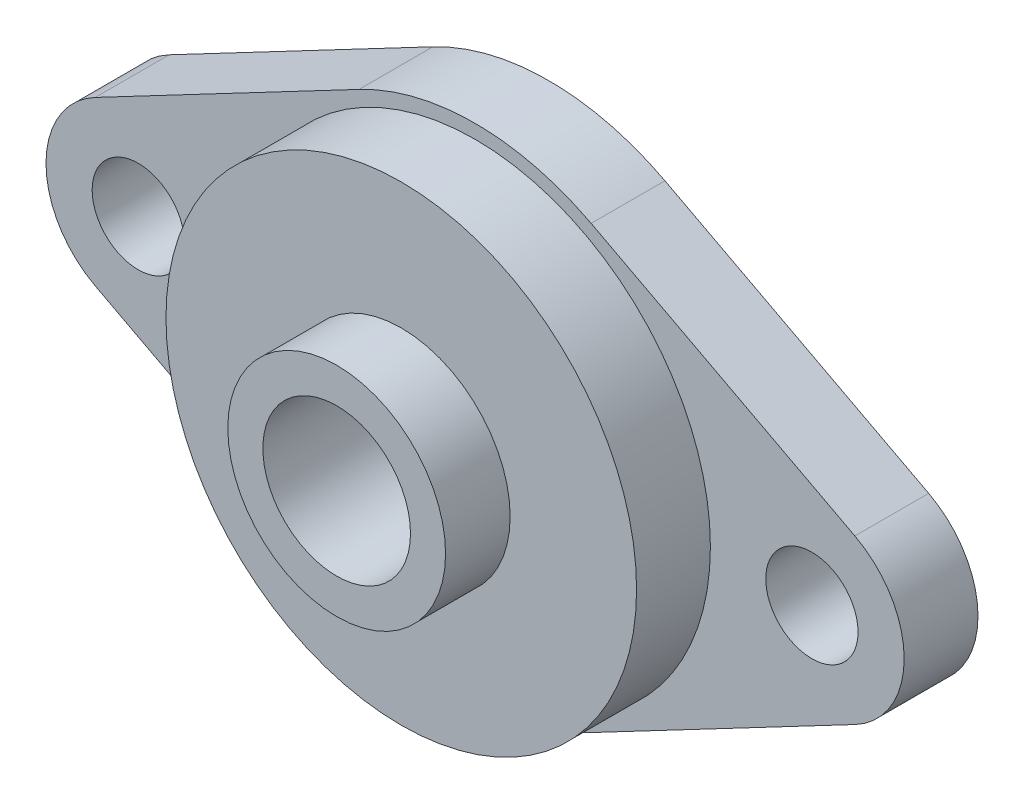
from build123d import *

# Parameters (mm, degrees)
ESQUISSE1_R        = 4
ESQUISSE1_R_2      = 2.5
BOSS_EXTRU_1_DEPTH = 4
ESQUISSE2_R        = 12.75
ESQUISSE2_R_2      = 4
BOSS_EXTRU_2_DEPTH = 4
ESQUISSE3_R        = 5.9
ESQUISSE3_R_2      = 4
BOSS_EXTRU_3_DEPTH = 3.5


with BuildPart() as part:
    # Esquisse1 → Boss.-Extru.1 (new body)
    with BuildSketch(Plane.XY):
        with BuildLine():
            Line((6.287671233, 11.946346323), (20.578767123, 4.424572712))
            ThreePointArc((20.578767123, 4.424572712), (23.25, 0), (20.578767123, -4.424572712))
            Line((20.578767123, -4.424572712), (6.287671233, -11.946346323))
            ThreePointArc((6.287671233, -11.946346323), (0, -13.5), (-6.287671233, -11.946346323))
            Line((-6.287671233, -11.946346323), (-20.578767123, -4.424572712))
            ThreePointArc((-20.578767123, -4.424572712), (-23.25, 0), (-20.578767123, 4.424572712))
            Line((-20.578767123, 4.424572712), (-6.287671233, 11.946346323))
            ThreePointArc((-6.287671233, 11.946346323), (0, 13.5), (6.287671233, 11.946346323))
        make_face()
        Circle(ESQUISSE1_R, mode=Mode.SUBTRACT)
        with Locations((18.25, 0)):
            Circle(ESQUISSE1_R_2, mode=Mode.SUBTRACT)
        with Locations(Location((-18.25, 0, 0), (0, 0, 180))):
            Circle(ESQUISSE1_R_2, mode=Mode.SUBTRACT)
    extrude(amount=BOSS_EXTRU_1_DEPTH)

    # Esquisse2 → Boss.-Extru.2 (add)
    with BuildSketch(Plane.XY.offset(4)):
        with Locations(Location((0, 0, 0), (0, 0, 180))):
            Circle(ESQUISSE2_R)
        Circle(ESQUISSE2_R_2, mode=Mode.SUBTRACT)
    extrude(amount=BOSS_EXTRU_2_DEPTH)

    # Esquisse3 → Boss.-Extru.3 (add)
    with BuildSketch(Plane.XY.offset(8)):
        Circle(ESQUISSE3_R)
        Circle(ESQUISSE3_R_2, mode=Mode.SUBTRACT)
    extrude(amount=BOSS_EXTRU_3_DEPTH)


solid = part.part
